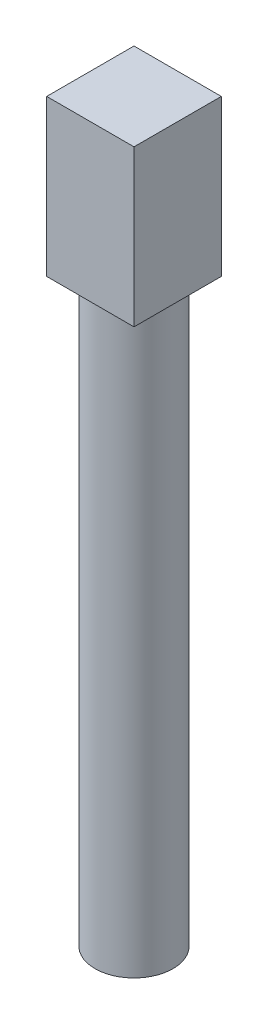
ISO-10303-21;
HEADER;
FILE_DESCRIPTION(('STEP AP214'),'2;1');
FILE_NAME('part.step','',(''),(''),'','','');
FILE_SCHEMA(('AUTOMOTIVE_DESIGN { 1 0 10303 214 1 1 1 1 }'));
ENDSEC;
DATA;
#1=APPLICATION_CONTEXT('core data for automotive mechanical design processes');
#2=APPLICATION_PROTOCOL_DEFINITION('international standard','automotive_design',2000,#1);
#3=PRODUCT_CONTEXT('',#1,'mechanical');
#4=PRODUCT('Part','Part','',(#3));
#5=PRODUCT_RELATED_PRODUCT_CATEGORY('part','',(#4));
#6=PRODUCT_DEFINITION_FORMATION('','',#4);
#7=PRODUCT_DEFINITION_CONTEXT('part definition',#1,'design');
#8=PRODUCT_DEFINITION('design','',#6,#7);
#9=PRODUCT_DEFINITION_SHAPE('','',#8);
#10=(LENGTH_UNIT() NAMED_UNIT(*) SI_UNIT(.MILLI.,.METRE.));
#11=(NAMED_UNIT(*) PLANE_ANGLE_UNIT() SI_UNIT($,.RADIAN.));
#12=(NAMED_UNIT(*) SI_UNIT($,.STERADIAN.) SOLID_ANGLE_UNIT());
#13=UNCERTAINTY_MEASURE_WITH_UNIT(LENGTH_MEASURE(1.E-05),#10,'distance_accuracy_value','');
#14=(GEOMETRIC_REPRESENTATION_CONTEXT(3) GLOBAL_UNCERTAINTY_ASSIGNED_CONTEXT((#13)) GLOBAL_UNIT_ASSIGNED_CONTEXT((#10,
#11,#12)) REPRESENTATION_CONTEXT('',''));
#15=CARTESIAN_POINT('',(0.,0.,0.));
#16=DIRECTION('',(0.,0.,1.));
#17=DIRECTION('',(1.,0.,0.));
#18=AXIS2_PLACEMENT_3D('',#15,#16,#17);
#19=CARTESIAN_POINT('',(0.,23.622,0.));
#20=DIRECTION('',(0.,-1.,0.));
#21=DIRECTION('',(0.,0.,-1.));
#22=AXIS2_PLACEMENT_3D('',#19,#20,#21);
#23=CYLINDRICAL_SURFACE('',#22,1.5875);
#24=CARTESIAN_POINT('',(0.,23.622,0.));
#25=DIRECTION('',(0.,1.,0.));
#26=DIRECTION('',(0.,0.,1.));
#27=AXIS2_PLACEMENT_3D('',#24,#25,#26);
#28=CIRCLE('',#27,1.5875);
#29=CARTESIAN_POINT('',(0.,23.622,1.5875));
#30=VERTEX_POINT('',#29);
#31=EDGE_CURVE('E11',#30,#30,#28,.T.);
#32=ORIENTED_EDGE('',*,*,#31,.F.);
#33=EDGE_LOOP('',(#32));
#34=FACE_BOUND('',#33,.T.);
#35=CARTESIAN_POINT('',(0.,0.,0.));
#36=DIRECTION('',(0.,1.,0.));
#37=DIRECTION('',(0.,0.,1.));
#38=AXIS2_PLACEMENT_3D('',#35,#36,#37);
#39=CIRCLE('',#38,1.5875);
#40=CARTESIAN_POINT('',(0.,0.,1.5875));
#41=VERTEX_POINT('',#40);
#42=EDGE_CURVE('E48',#41,#41,#39,.T.);
#43=ORIENTED_EDGE('',*,*,#42,.T.);
#44=EDGE_LOOP('',(#43));
#45=FACE_BOUND('',#44,.T.);
#46=ADVANCED_FACE('F45',(#34,#45),#23,.T.);
#47=CARTESIAN_POINT('',(0.,0.,0.));
#48=DIRECTION('',(0.,1.,0.));
#49=DIRECTION('',(0.,0.,1.));
#50=AXIS2_PLACEMENT_3D('',#47,#48,#49);
#51=PLANE('',#50);
#52=ORIENTED_EDGE('',*,*,#42,.F.);
#53=EDGE_LOOP('',(#52));
#54=FACE_BOUND('',#53,.T.);
#55=ADVANCED_FACE('F137',(#54),#51,.F.);
#56=CARTESIAN_POINT('',(1.778,29.972,-1.778));
#57=DIRECTION('',(-1.,0.,0.));
#58=DIRECTION('',(0.,0.,1.));
#59=AXIS2_PLACEMENT_3D('',#56,#57,#58);
#60=PLANE('',#59);
#61=DIRECTION('',(0.,0.,-1.));
#62=VECTOR('',#61,1.);
#63=CARTESIAN_POINT('',(1.778,23.622,-1.778));
#64=LINE('',#63,#62);
#65=CARTESIAN_POINT('',(1.778,23.622,1.778));
#66=VERTEX_POINT('',#65);
#67=CARTESIAN_POINT('',(1.778,23.622,-1.778));
#68=VERTEX_POINT('',#67);
#69=EDGE_CURVE('E117',#66,#68,#64,.T.);
#70=ORIENTED_EDGE('',*,*,#69,.T.);
#71=DIRECTION('',(0.,-1.,0.));
#72=VECTOR('',#71,1.);
#73=CARTESIAN_POINT('',(1.778,29.972,-1.778));
#74=LINE('',#73,#72);
#75=CARTESIAN_POINT('',(1.778,29.972,-1.778));
#76=VERTEX_POINT('',#75);
#77=EDGE_CURVE('E106',#76,#68,#74,.T.);
#78=ORIENTED_EDGE('',*,*,#77,.F.);
#79=DIRECTION('',(0.,0.,-1.));
#80=VECTOR('',#79,1.);
#81=CARTESIAN_POINT('',(1.778,29.972,-1.778));
#82=LINE('',#81,#80);
#83=CARTESIAN_POINT('',(1.778,29.972,1.778));
#84=VERTEX_POINT('',#83);
#85=EDGE_CURVE('E98',#84,#76,#82,.T.);
#86=ORIENTED_EDGE('',*,*,#85,.F.);
#87=DIRECTION('',(0.,-1.,0.));
#88=VECTOR('',#87,1.);
#89=CARTESIAN_POINT('',(1.778,29.972,1.778));
#90=LINE('',#89,#88);
#91=EDGE_CURVE('E113',#84,#66,#90,.T.);
#92=ORIENTED_EDGE('',*,*,#91,.T.);
#93=EDGE_LOOP('',(#70,#78,#86,#92));
#94=FACE_BOUND('',#93,.T.);
#95=ADVANCED_FACE('F139',(#94),#60,.F.);
#96=CARTESIAN_POINT('',(-1.778,29.972,-1.778));
#97=DIRECTION('',(0.,0.,1.));
#98=DIRECTION('',(1.,0.,0.));
#99=AXIS2_PLACEMENT_3D('',#96,#97,#98);
#100=PLANE('',#99);
#101=DIRECTION('',(-1.,0.,0.));
#102=VECTOR('',#101,1.);
#103=CARTESIAN_POINT('',(-1.778,23.622,-1.778));
#104=LINE('',#103,#102);
#105=CARTESIAN_POINT('',(-1.778,23.622,-1.778));
#106=VERTEX_POINT('',#105);
#107=EDGE_CURVE('E104',#68,#106,#104,.T.);
#108=ORIENTED_EDGE('',*,*,#107,.T.);
#109=DIRECTION('',(0.,-1.,0.));
#110=VECTOR('',#109,1.);
#111=CARTESIAN_POINT('',(-1.778,29.972,-1.778));
#112=LINE('',#111,#110);
#113=CARTESIAN_POINT('',(-1.778,29.972,-1.778));
#114=VERTEX_POINT('',#113);
#115=EDGE_CURVE('E102',#114,#106,#112,.T.);
#116=ORIENTED_EDGE('',*,*,#115,.F.);
#117=DIRECTION('',(-1.,0.,0.));
#118=VECTOR('',#117,1.);
#119=CARTESIAN_POINT('',(-1.778,29.972,-1.778));
#120=LINE('',#119,#118);
#121=EDGE_CURVE('E93',#76,#114,#120,.T.);
#122=ORIENTED_EDGE('',*,*,#121,.F.);
#123=ORIENTED_EDGE('',*,*,#77,.T.);
#124=EDGE_LOOP('',(#108,#116,#122,#123));
#125=FACE_BOUND('',#124,.T.);
#126=ADVANCED_FACE('F103',(#125),#100,.F.);
#127=CARTESIAN_POINT('',(-1.778,29.972,-1.778));
#128=DIRECTION('',(1.,0.,0.));
#129=DIRECTION('',(0.,0.,-1.));
#130=AXIS2_PLACEMENT_3D('',#127,#128,#129);
#131=PLANE('',#130);
#132=DIRECTION('',(0.,0.,1.));
#133=VECTOR('',#132,1.);
#134=CARTESIAN_POINT('',(-1.778,23.622,-1.778));
#135=LINE('',#134,#133);
#136=CARTESIAN_POINT('',(-1.778,23.622,1.778));
#137=VERTEX_POINT('',#136);
#138=EDGE_CURVE('E79',#106,#137,#135,.T.);
#139=ORIENTED_EDGE('',*,*,#138,.T.);
#140=DIRECTION('',(0.,-1.,0.));
#141=VECTOR('',#140,1.);
#142=CARTESIAN_POINT('',(-1.778,29.972,1.778));
#143=LINE('',#142,#141);
#144=CARTESIAN_POINT('',(-1.778,29.972,1.778));
#145=VERTEX_POINT('',#144);
#146=EDGE_CURVE('E107',#145,#137,#143,.T.);
#147=ORIENTED_EDGE('',*,*,#146,.F.);
#148=DIRECTION('',(0.,0.,1.));
#149=VECTOR('',#148,1.);
#150=CARTESIAN_POINT('',(-1.778,29.972,-1.778));
#151=LINE('',#150,#149);
#152=EDGE_CURVE('E96',#114,#145,#151,.T.);
#153=ORIENTED_EDGE('',*,*,#152,.F.);
#154=ORIENTED_EDGE('',*,*,#115,.T.);
#155=EDGE_LOOP('',(#139,#147,#153,#154));
#156=FACE_BOUND('',#155,.T.);
#157=ADVANCED_FACE('F109',(#156),#131,.F.);
#158=CARTESIAN_POINT('',(-1.778,29.972,1.778));
#159=DIRECTION('',(0.,0.,-1.));
#160=DIRECTION('',(-1.,0.,0.));
#161=AXIS2_PLACEMENT_3D('',#158,#159,#160);
#162=PLANE('',#161);
#163=DIRECTION('',(1.,0.,0.));
#164=VECTOR('',#163,1.);
#165=CARTESIAN_POINT('',(-1.778,23.622,1.778));
#166=LINE('',#165,#164);
#167=EDGE_CURVE('E85',#137,#66,#166,.T.);
#168=ORIENTED_EDGE('',*,*,#167,.T.);
#169=ORIENTED_EDGE('',*,*,#91,.F.);
#170=DIRECTION('',(1.,0.,0.));
#171=VECTOR('',#170,1.);
#172=CARTESIAN_POINT('',(-1.778,29.972,1.778));
#173=LINE('',#172,#171);
#174=EDGE_CURVE('E62',#145,#84,#173,.T.);
#175=ORIENTED_EDGE('',*,*,#174,.F.);
#176=ORIENTED_EDGE('',*,*,#146,.T.);
#177=EDGE_LOOP('',(#168,#169,#175,#176));
#178=FACE_BOUND('',#177,.T.);
#179=ADVANCED_FACE('F152',(#178),#162,.F.);
#180=CARTESIAN_POINT('',(0.,29.972,0.));
#181=DIRECTION('',(0.,1.,0.));
#182=DIRECTION('',(0.,0.,1.));
#183=AXIS2_PLACEMENT_3D('',#180,#181,#182);
#184=PLANE('',#183);
#185=ORIENTED_EDGE('',*,*,#85,.T.);
#186=ORIENTED_EDGE('',*,*,#121,.T.);
#187=ORIENTED_EDGE('',*,*,#152,.T.);
#188=ORIENTED_EDGE('',*,*,#174,.T.);
#189=EDGE_LOOP('',(#185,#186,#187,#188));
#190=FACE_BOUND('',#189,.T.);
#191=ADVANCED_FACE('F94',(#190),#184,.T.);
#192=CARTESIAN_POINT('',(0.,23.622,0.));
#193=DIRECTION('',(0.,1.,0.));
#194=DIRECTION('',(0.,0.,1.));
#195=AXIS2_PLACEMENT_3D('',#192,#193,#194);
#196=PLANE('',#195);
#197=ORIENTED_EDGE('',*,*,#31,.T.);
#198=EDGE_LOOP('',(#197));
#199=FACE_BOUND('',#198,.T.);
#200=ORIENTED_EDGE('',*,*,#69,.F.);
#201=ORIENTED_EDGE('',*,*,#167,.F.);
#202=ORIENTED_EDGE('',*,*,#138,.F.);
#203=ORIENTED_EDGE('',*,*,#107,.F.);
#204=EDGE_LOOP('',(#200,#201,#202,#203));
#205=FACE_BOUND('',#204,.T.);
#206=ADVANCED_FACE('F155',(#199,#205),#196,.F.);
#207=CLOSED_SHELL('',(#46,#55,#95,#126,#157,#179,#191,#206));
#208=MANIFOLD_SOLID_BREP('B2',#207);
#209=ADVANCED_BREP_SHAPE_REPRESENTATION('',(#18,#208),#14);
#210=SHAPE_DEFINITION_REPRESENTATION(#9,#209);
ENDSEC;
END-ISO-10303-21;
